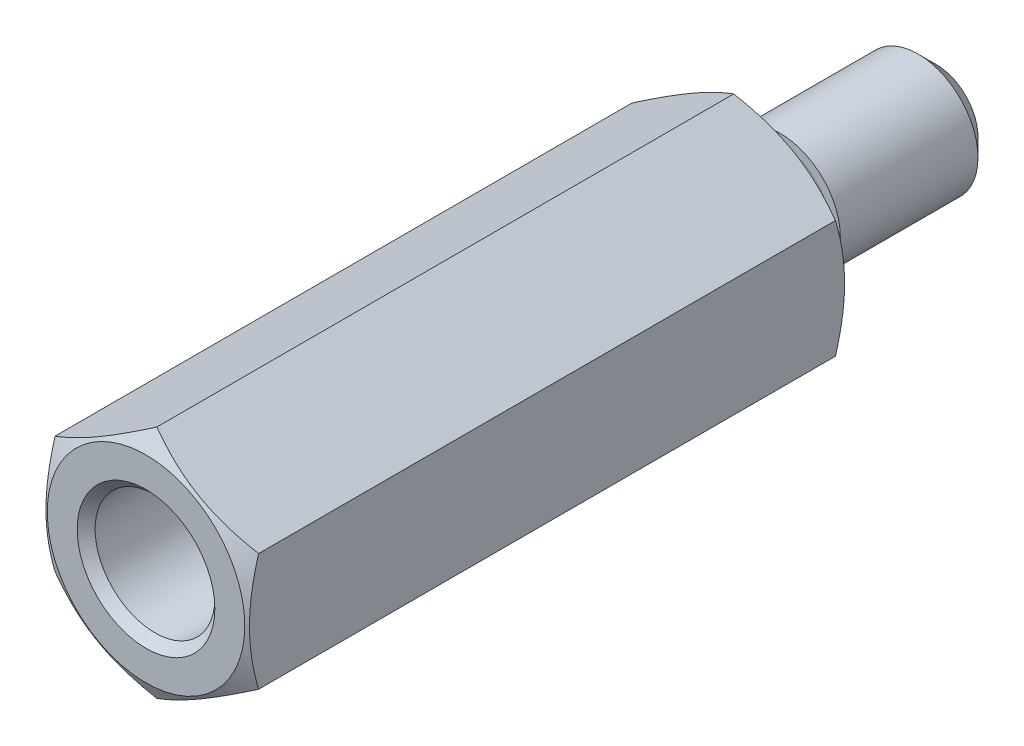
ISO-10303-21;
HEADER;
FILE_DESCRIPTION(('STEP AP214'),'2;1');
FILE_NAME('part.step','',(''),(''),'','','');
FILE_SCHEMA(('AUTOMOTIVE_DESIGN { 1 0 10303 214 1 1 1 1 }'));
ENDSEC;
DATA;
#1=APPLICATION_CONTEXT('core data for automotive mechanical design processes');
#2=APPLICATION_PROTOCOL_DEFINITION('international standard','automotive_design',2000,#1);
#3=PRODUCT_CONTEXT('',#1,'mechanical');
#4=PRODUCT('Part','Part','',(#3));
#5=PRODUCT_RELATED_PRODUCT_CATEGORY('part','',(#4));
#6=PRODUCT_DEFINITION_FORMATION('','',#4);
#7=PRODUCT_DEFINITION_CONTEXT('part definition',#1,'design');
#8=PRODUCT_DEFINITION('design','',#6,#7);
#9=PRODUCT_DEFINITION_SHAPE('','',#8);
#10=(LENGTH_UNIT() NAMED_UNIT(*) SI_UNIT(.MILLI.,.METRE.));
#11=(NAMED_UNIT(*) PLANE_ANGLE_UNIT() SI_UNIT($,.RADIAN.));
#12=(NAMED_UNIT(*) SI_UNIT($,.STERADIAN.) SOLID_ANGLE_UNIT());
#13=UNCERTAINTY_MEASURE_WITH_UNIT(LENGTH_MEASURE(1.E-05),#10,'distance_accuracy_value','');
#14=(GEOMETRIC_REPRESENTATION_CONTEXT(3) GLOBAL_UNCERTAINTY_ASSIGNED_CONTEXT((#13)) GLOBAL_UNIT_ASSIGNED_CONTEXT((#10,
#11,#12)) REPRESENTATION_CONTEXT('',''));
#15=CARTESIAN_POINT('',(0.,0.,0.));
#16=DIRECTION('',(0.,0.,1.));
#17=DIRECTION('',(1.,0.,0.));
#18=AXIS2_PLACEMENT_3D('',#15,#16,#17);
#19=CARTESIAN_POINT('',(8.5,4.90747728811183,0.));
#20=DIRECTION('',(0.,0.,-1.));
#21=DIRECTION('',(-1.,0.,0.));
#22=AXIS2_PLACEMENT_3D('',#19,#20,#21);
#23=PLANE('',#22);
#24=CARTESIAN_POINT('',(0.,0.,0.));
#25=DIRECTION('',(0.,0.,-1.));
#26=DIRECTION('',(-1.,0.,0.));
#27=AXIS2_PLACEMENT_3D('',#24,#25,#26);
#28=CIRCLE('',#27,4.25);
#29=CARTESIAN_POINT('',(-4.25,0.,0.));
#30=VERTEX_POINT('',#29);
#31=EDGE_CURVE('E9',#30,#30,#28,.F.);
#32=ORIENTED_EDGE('',*,*,#31,.T.);
#33=EDGE_LOOP('',(#32));
#34=FACE_BOUND('',#33,.T.);
#35=CARTESIAN_POINT('',(0.,0.,0.));
#36=DIRECTION('',(0.,0.,1.));
#37=DIRECTION('',(1.,0.,0.));
#38=AXIS2_PLACEMENT_3D('',#35,#36,#37);
#39=CIRCLE('',#38,8.25);
#40=CARTESIAN_POINT('',(8.25,0.,0.));
#41=VERTEX_POINT('',#40);
#42=EDGE_CURVE('E136',#41,#41,#39,.T.);
#43=ORIENTED_EDGE('',*,*,#42,.F.);
#44=EDGE_LOOP('',(#43));
#45=FACE_BOUND('',#44,.T.);
#46=ADVANCED_FACE('F14',(#34,#45),#23,.T.);
#47=CARTESIAN_POINT('',(0.,0.,42.756485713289));
#48=DIRECTION('',(0.,0.,1.));
#49=DIRECTION('',(1.,0.,0.));
#50=AXIS2_PLACEMENT_3D('',#47,#48,#49);
#51=CYLINDRICAL_SURFACE('',#50,3.85);
#52=CARTESIAN_POINT('',(0.,0.,-2.6));
#53=DIRECTION('',(0.,0.,-1.));
#54=DIRECTION('',(-1.,0.,0.));
#55=AXIS2_PLACEMENT_3D('',#52,#53,#54);
#56=CIRCLE('',#55,3.85);
#57=CARTESIAN_POINT('',(-3.85,0.,-2.6));
#58=VERTEX_POINT('',#57);
#59=EDGE_CURVE('E103',#58,#58,#56,.F.);
#60=ORIENTED_EDGE('',*,*,#59,.T.);
#61=EDGE_LOOP('',(#60));
#62=FACE_BOUND('',#61,.T.);
#63=CARTESIAN_POINT('',(0.,0.,-0.4));
#64=DIRECTION('',(0.,0.,-1.));
#65=DIRECTION('',(-1.,0.,0.));
#66=AXIS2_PLACEMENT_3D('',#63,#64,#65);
#67=CIRCLE('',#66,3.85);
#68=CARTESIAN_POINT('',(-3.85,0.,-0.4));
#69=VERTEX_POINT('',#68);
#70=EDGE_CURVE('E100',#69,#69,#67,.T.);
#71=ORIENTED_EDGE('',*,*,#70,.T.);
#72=EDGE_LOOP('',(#71));
#73=FACE_BOUND('',#72,.T.);
#74=ADVANCED_FACE('F120',(#62,#73),#51,.T.);
#75=CARTESIAN_POINT('',(0.,3.85,-3.));
#76=DIRECTION('',(0.,0.,-1.));
#77=DIRECTION('',(-1.,0.,0.));
#78=AXIS2_PLACEMENT_3D('',#75,#76,#77);
#79=PLANE('',#78);
#80=CARTESIAN_POINT('',(0.,0.,-3.));
#81=DIRECTION('',(0.,0.,-1.));
#82=DIRECTION('',(-1.,0.,0.));
#83=AXIS2_PLACEMENT_3D('',#80,#81,#82);
#84=CIRCLE('',#83,4.25);
#85=CARTESIAN_POINT('',(-4.25,0.,-3.));
#86=VERTEX_POINT('',#85);
#87=EDGE_CURVE('E24',#86,#86,#84,.T.);
#88=ORIENTED_EDGE('',*,*,#87,.T.);
#89=EDGE_LOOP('',(#88));
#90=FACE_BOUND('',#89,.T.);
#91=CARTESIAN_POINT('',(0.,0.,-3.));
#92=DIRECTION('',(0.,0.,1.));
#93=DIRECTION('',(1.,0.,0.));
#94=AXIS2_PLACEMENT_3D('',#91,#92,#93);
#95=CIRCLE('',#94,5.);
#96=CARTESIAN_POINT('',(5.,0.,-3.));
#97=VERTEX_POINT('',#96);
#98=EDGE_CURVE('E269',#97,#97,#95,.T.);
#99=ORIENTED_EDGE('',*,*,#98,.T.);
#100=EDGE_LOOP('',(#99));
#101=FACE_BOUND('',#100,.T.);
#102=ADVANCED_FACE('F109',(#90,#101),#79,.F.);
#103=CARTESIAN_POINT('',(0.,0.,42.756485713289));
#104=DIRECTION('',(0.,0.,1.));
#105=DIRECTION('',(1.,0.,0.));
#106=AXIS2_PLACEMENT_3D('',#103,#104,#105);
#107=CYLINDRICAL_SURFACE('',#106,5.);
#108=CARTESIAN_POINT('',(0.,0.,-14.5));
#109=DIRECTION('',(0.,0.,1.));
#110=DIRECTION('',(1.,0.,0.));
#111=AXIS2_PLACEMENT_3D('',#108,#109,#110);
#112=CIRCLE('',#111,5.);
#113=CARTESIAN_POINT('',(5.,0.,-14.5));
#114=VERTEX_POINT('',#113);
#115=EDGE_CURVE('E88',#114,#114,#112,.T.);
#116=ORIENTED_EDGE('',*,*,#115,.T.);
#117=EDGE_LOOP('',(#116));
#118=FACE_BOUND('',#117,.T.);
#119=ORIENTED_EDGE('',*,*,#98,.F.);
#120=EDGE_LOOP('',(#119));
#121=FACE_BOUND('',#120,.T.);
#122=ADVANCED_FACE('F392',(#118,#121),#107,.T.);
#123=CARTESIAN_POINT('',(0.,5.,-16.));
#124=DIRECTION('',(0.,0.,1.));
#125=DIRECTION('',(1.,0.,0.));
#126=AXIS2_PLACEMENT_3D('',#123,#124,#125);
#127=PLANE('',#126);
#128=CARTESIAN_POINT('',(0.,0.,-16.));
#129=DIRECTION('',(0.,0.,1.));
#130=DIRECTION('',(1.,0.,0.));
#131=AXIS2_PLACEMENT_3D('',#128,#129,#130);
#132=CIRCLE('',#131,3.5);
#133=CARTESIAN_POINT('',(3.5,0.,-16.));
#134=VERTEX_POINT('',#133);
#135=EDGE_CURVE('E92',#134,#134,#132,.F.);
#136=ORIENTED_EDGE('',*,*,#135,.T.);
#137=EDGE_LOOP('',(#136));
#138=FACE_BOUND('',#137,.T.);
#139=ADVANCED_FACE('F382',(#138),#127,.F.);
#140=CARTESIAN_POINT('',(0.,0.,-14.5));
#141=DIRECTION('',(0.,0.,1.));
#142=DIRECTION('',(1.,0.,0.));
#143=AXIS2_PLACEMENT_3D('',#140,#141,#142);
#144=CONICAL_SURFACE('',#143,5.,0.785398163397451);
#145=ORIENTED_EDGE('',*,*,#135,.F.);
#146=EDGE_LOOP('',(#145));
#147=FACE_BOUND('',#146,.T.);
#148=ORIENTED_EDGE('',*,*,#115,.F.);
#149=EDGE_LOOP('',(#148));
#150=FACE_BOUND('',#149,.T.);
#151=ADVANCED_FACE('F116',(#147,#150),#144,.T.);
#152=CARTESIAN_POINT('',(0.,0.,-2.6));
#153=DIRECTION('',(0.,0.,-1.));
#154=DIRECTION('',(-1.,0.,0.));
#155=AXIS2_PLACEMENT_3D('',#152,#153,#154);
#156=TOROIDAL_SURFACE('',#155,4.25,0.4);
#157=ORIENTED_EDGE('',*,*,#87,.F.);
#158=EDGE_LOOP('',(#157));
#159=FACE_BOUND('',#158,.T.);
#160=ORIENTED_EDGE('',*,*,#59,.F.);
#161=EDGE_LOOP('',(#160));
#162=FACE_BOUND('',#161,.T.);
#163=ADVANCED_FACE('F112',(#159,#162),#156,.F.);
#164=CARTESIAN_POINT('',(0.,0.,-0.4));
#165=DIRECTION('',(0.,0.,-1.));
#166=DIRECTION('',(-1.,0.,0.));
#167=AXIS2_PLACEMENT_3D('',#164,#165,#166);
#168=TOROIDAL_SURFACE('',#167,4.25,0.4);
#169=ORIENTED_EDGE('',*,*,#70,.F.);
#170=EDGE_LOOP('',(#169));
#171=FACE_BOUND('',#170,.T.);
#172=ORIENTED_EDGE('',*,*,#31,.F.);
#173=EDGE_LOOP('',(#172));
#174=FACE_BOUND('',#173,.T.);
#175=ADVANCED_FACE('F115',(#171,#174),#168,.F.);
#176=CARTESIAN_POINT('',(0.,0.,0.903526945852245));
#177=DIRECTION('',(0.,0.,1.));
#178=DIRECTION('',(1.,0.,0.));
#179=AXIS2_PLACEMENT_3D('',#176,#177,#178);
#180=CONICAL_SURFACE('',#179,9.81495457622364,1.0471975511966);
#181=ORIENTED_EDGE('',*,*,#42,.T.);
#182=EDGE_LOOP('',(#181));
#183=FACE_BOUND('',#182,.T.);
#184=CARTESIAN_POINT('',(-0.000199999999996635,9.81507004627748,0.903593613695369));
#185=CARTESIAN_POINT('',(0.186639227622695,9.70719836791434,0.841323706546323));
#186=CARTESIAN_POINT('',(0.374175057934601,9.59892450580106,0.781879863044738));
#187=CARTESIAN_POINT('',(0.750769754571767,9.38149745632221,0.669422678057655));
#188=CARTESIAN_POINT('',(0.939829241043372,9.27234391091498,0.616412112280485));
#189=CARTESIAN_POINT('',(1.5100347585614,8.94313560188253,0.468070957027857));
#190=CARTESIAN_POINT('',(1.89343164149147,8.72178130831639,0.383696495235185));
#191=CARTESIAN_POINT('',(2.46717766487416,8.39052888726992,0.284757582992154));
#192=CARTESIAN_POINT('',(2.65581276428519,8.28162036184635,0.256572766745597));
#193=CARTESIAN_POINT('',(3.03393602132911,8.06331079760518,0.209311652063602));
#194=CARTESIAN_POINT('',(3.22342410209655,7.95390980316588,0.190234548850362));
#195=CARTESIAN_POINT('',(3.60272652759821,7.73491944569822,0.161672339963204));
#196=CARTESIAN_POINT('',(3.7925402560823,7.62533043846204,0.152176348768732));
#197=CARTESIAN_POINT('',(4.17234305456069,7.40605119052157,0.142979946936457));
#198=CARTESIAN_POINT('',(4.36233211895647,7.29636095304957,0.14327923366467));
#199=CARTESIAN_POINT('',(4.71752301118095,7.09129139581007,0.152992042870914));
#200=CARTESIAN_POINT('',(4.8827499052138,6.99589760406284,0.161220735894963));
#201=CARTESIAN_POINT('',(5.21281671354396,6.80533344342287,0.184926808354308));
#202=CARTESIAN_POINT('',(5.37765660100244,6.71016309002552,0.200404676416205));
#203=CARTESIAN_POINT('',(5.87153810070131,6.4250204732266,0.257346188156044));
#204=CARTESIAN_POINT('',(6.19970550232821,6.23555293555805,0.309310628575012));
#205=CARTESIAN_POINT('',(6.85952142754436,5.85460803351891,0.439222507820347));
#206=CARTESIAN_POINT('',(7.19108574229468,5.66317928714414,0.51772063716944));
#207=CARTESIAN_POINT('',(7.84926989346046,5.28317649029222,0.695878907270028));
#208=CARTESIAN_POINT('',(8.17589815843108,5.0945975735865,0.795497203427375));
#209=CARTESIAN_POINT('',(8.5002,4.90736181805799,0.903593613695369));
#210=B_SPLINE_CURVE_WITH_KNOTS('',3,(#184,#185,#186,#187,#188,#189,#190,#191,#192,#193,#194,
#195,#196,#197,#198,#199,#200,#201,#202,#203,#204,#205,#206,#207,#208,#209),.UNSPECIFIED.,.F.,
.F.,(4,2,2,2,2,2,2,2,2,2,2,2,4),(0.,0.673596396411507,1.34748239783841,2.69805431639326,
3.356799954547,4.01548737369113,4.67342558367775,5.33134346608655,5.90409556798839,
6.47688628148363,7.62328361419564,8.79510569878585,9.96462743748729),.UNSPECIFIED.);
#211=CARTESIAN_POINT('',(0.,9.81495457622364,0.903526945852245));
#212=VERTEX_POINT('',#211);
#213=CARTESIAN_POINT('',(8.5,4.90747728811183,0.903526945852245));
#214=VERTEX_POINT('',#213);
#215=EDGE_CURVE('E31',#212,#214,#210,.T.);
#216=ORIENTED_EDGE('',*,*,#215,.T.);
#217=CARTESIAN_POINT('',(8.5,-12.9953438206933,4.20214445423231));
#218=CARTESIAN_POINT('',(8.5,-12.6223011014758,4.02195280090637));
#219=CARTESIAN_POINT('',(8.5,-12.2483741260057,3.84355854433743));
#220=CARTESIAN_POINT('',(8.5,-11.4982734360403,3.49139239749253));
#221=CARTESIAN_POINT('',(8.5,-11.1220993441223,3.31762131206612));
#222=CARTESIAN_POINT('',(8.5,-10.3649842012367,2.97480925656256));
#223=CARTESIAN_POINT('',(8.5,-9.98402817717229,2.80580123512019));
#224=CARTESIAN_POINT('',(8.5,-9.21897765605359,2.47507337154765));
#225=CARTESIAN_POINT('',(8.5,-8.83488332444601,2.31335314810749));
#226=CARTESIAN_POINT('',(8.5,-8.05827000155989,1.99725792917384));
#227=CARTESIAN_POINT('',(8.5,-7.66570525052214,1.84299473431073));
#228=CARTESIAN_POINT('',(8.5,-6.87593938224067,1.54660014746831));
#229=CARTESIAN_POINT('',(8.5,-6.47873775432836,1.40447010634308));
#230=CARTESIAN_POINT('',(8.5,-5.67988381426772,1.13617601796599));
#231=CARTESIAN_POINT('',(8.5,-5.27824308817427,1.00997785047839));
#232=CARTESIAN_POINT('',(8.5,-4.46926711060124,0.777656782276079));
#233=CARTESIAN_POINT('',(8.5,-4.06193370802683,0.671527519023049));
#234=CARTESIAN_POINT('',(8.5,-3.24121808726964,0.484515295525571));
#235=CARTESIAN_POINT('',(8.5,-2.82783404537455,0.403640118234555));
#236=CARTESIAN_POINT('',(8.5,-2.20413783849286,0.305328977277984));
#237=CARTESIAN_POINT('',(8.5,-1.99561028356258,0.276390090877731));
#238=CARTESIAN_POINT('',(8.5,-1.57758365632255,0.226749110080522));
#239=CARTESIAN_POINT('',(8.5,-1.36808467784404,0.206046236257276));
#240=CARTESIAN_POINT('',(8.5,-0.94971684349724,0.173433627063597));
#241=CARTESIAN_POINT('',(8.5,-0.740852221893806,0.161469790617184));
#242=CARTESIAN_POINT('',(8.5,-0.322804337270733,0.146398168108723));
#243=CARTESIAN_POINT('',(8.5,-0.11362107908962,0.143290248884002));
#244=CARTESIAN_POINT('',(8.5,0.3046299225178,0.14600440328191));
#245=CARTESIAN_POINT('',(8.5,0.513697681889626,0.151823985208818));
#246=CARTESIAN_POINT('',(8.5,0.93140649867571,0.172248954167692));
#247=CARTESIAN_POINT('',(8.5,1.14004753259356,0.186854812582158));
#248=CARTESIAN_POINT('',(8.5,1.64621912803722,0.232643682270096));
#249=CARTESIAN_POINT('',(8.5,1.94335676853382,0.268255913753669));
#250=CARTESIAN_POINT('',(8.5,2.53529083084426,0.355313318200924));
#251=CARTESIAN_POINT('',(8.5,2.83008689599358,0.406760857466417));
#252=CARTESIAN_POINT('',(8.5,3.71148367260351,0.582274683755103));
#253=CARTESIAN_POINT('',(8.5,4.29393978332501,0.727394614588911));
#254=CARTESIAN_POINT('',(8.5,5.16515755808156,0.977457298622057));
#255=CARTESIAN_POINT('',(8.5,5.45847541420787,1.06742556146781));
#256=CARTESIAN_POINT('',(8.5,6.04227759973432,1.25629246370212));
#257=CARTESIAN_POINT('',(8.5,6.33276167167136,1.35519190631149));
#258=CARTESIAN_POINT('',(8.5,6.90944623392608,1.55980497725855));
#259=CARTESIAN_POINT('',(8.5,7.19566165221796,1.66547695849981));
#260=CARTESIAN_POINT('',(8.5,7.76565926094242,1.88291533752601));
#261=CARTESIAN_POINT('',(8.5,8.04944225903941,1.99467961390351));
#262=CARTESIAN_POINT('',(8.5,8.33220149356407,2.10891920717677));
#263=B_SPLINE_CURVE_WITH_KNOTS('',3,(#217,#218,#219,#220,#221,#222,#223,#224,#225,#226,#227,
#228,#229,#230,#231,#232,#233,#234,#235,#236,#237,#238,#239,#240,#241,#242,#243,#244,#245,#246,
#247,#248,#249,#250,#251,#252,#253,#254,#255,#256,#257,#258,#259,#260,#261,#262),.UNSPECIFIED.,
.F.,.F.,(4,2,2,2,2,2,2,2,2,2,2,2,2,2,2,2,2,2,2,2,2,2,4),(0.,1.24286396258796,2.48594289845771,
3.73617049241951,4.98633259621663,6.25153784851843,7.51688378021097,8.77947209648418,
10.0416594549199,11.3042354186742,11.93567629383,12.5670573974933,13.1944958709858,
13.8219249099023,14.4491788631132,15.0764664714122,15.9737486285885,16.8711649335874,
18.6694595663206,19.5898052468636,20.5102337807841,21.4254630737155,22.3403756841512),.UNSPECIFIED.);
#264=CARTESIAN_POINT('',(8.5,-4.90747728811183,0.903526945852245));
#265=VERTEX_POINT('',#264);
#266=EDGE_CURVE('E138',#214,#265,#263,.F.);
#267=ORIENTED_EDGE('',*,*,#266,.T.);
#268=CARTESIAN_POINT('',(8.5002,-4.90736181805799,0.903593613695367));
#269=CARTESIAN_POINT('',(8.31336077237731,-5.01523349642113,0.841323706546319));
#270=CARTESIAN_POINT('',(8.1258249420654,-5.12350735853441,0.781879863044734));
#271=CARTESIAN_POINT('',(7.74923024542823,-5.34093440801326,0.66942267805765));
#272=CARTESIAN_POINT('',(7.56017075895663,-5.45008795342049,0.61641211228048));
#273=CARTESIAN_POINT('',(6.9899652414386,-5.77929626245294,0.468070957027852));
#274=CARTESIAN_POINT('',(6.60656835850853,-6.00065055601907,0.383696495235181));
#275=CARTESIAN_POINT('',(6.03282233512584,-6.33190297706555,0.28475758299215));
#276=CARTESIAN_POINT('',(5.84418723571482,-6.44081150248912,0.256572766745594));
#277=CARTESIAN_POINT('',(5.46606397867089,-6.65912106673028,0.209311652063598));
#278=CARTESIAN_POINT('',(5.27657589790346,-6.76852206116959,0.190234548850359));
#279=CARTESIAN_POINT('',(4.8972734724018,-6.98751241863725,0.161672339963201));
#280=CARTESIAN_POINT('',(4.70745974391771,-7.09710142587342,0.152176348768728));
#281=CARTESIAN_POINT('',(4.32765694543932,-7.3163806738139,0.142979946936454));
#282=CARTESIAN_POINT('',(4.13766788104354,-7.42607091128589,0.143279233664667));
#283=CARTESIAN_POINT('',(3.78247698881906,-7.63114046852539,0.152992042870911));
#284=CARTESIAN_POINT('',(3.6172500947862,-7.72653426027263,0.161220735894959));
#285=CARTESIAN_POINT('',(3.28718328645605,-7.9170984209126,0.184926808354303));
#286=CARTESIAN_POINT('',(3.12234339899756,-8.01226877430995,0.2004046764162));
#287=CARTESIAN_POINT('',(2.62846189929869,-8.29741139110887,0.25734618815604));
#288=CARTESIAN_POINT('',(2.30029449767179,-8.48687892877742,0.309310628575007));
#289=CARTESIAN_POINT('',(1.64047857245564,-8.86782383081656,0.439222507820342));
#290=CARTESIAN_POINT('',(1.30891425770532,-9.05925257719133,0.517720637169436));
#291=CARTESIAN_POINT('',(0.650730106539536,-9.43925537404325,0.695878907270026));
#292=CARTESIAN_POINT('',(0.324101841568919,-9.62783429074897,0.795497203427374));
#293=CARTESIAN_POINT('',(-0.000200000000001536,-9.81507004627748,0.903593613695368));
#294=B_SPLINE_CURVE_WITH_KNOTS('',3,(#268,#269,#270,#271,#272,#273,#274,#275,#276,#277,#278,
#279,#280,#281,#282,#283,#284,#285,#286,#287,#288,#289,#290,#291,#292,#293),.UNSPECIFIED.,.F.,
.F.,(4,2,2,2,2,2,2,2,2,2,2,2,4),(0.,0.673596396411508,1.34748239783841,2.69805431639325,
3.35679995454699,4.01548737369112,4.67342558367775,5.33134346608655,5.90409556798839,
6.47688628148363,7.62328361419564,8.79510569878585,9.9646274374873),.UNSPECIFIED.);
#295=CARTESIAN_POINT('',(0.,-9.81495457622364,0.903526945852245));
#296=VERTEX_POINT('',#295);
#297=EDGE_CURVE('E140',#265,#296,#294,.T.);
#298=ORIENTED_EDGE('',*,*,#297,.T.);
#299=CARTESIAN_POINT('',(0.000199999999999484,-9.81507004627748,0.903593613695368));
#300=CARTESIAN_POINT('',(-0.18663922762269,-9.70719836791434,0.84132370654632));
#301=CARTESIAN_POINT('',(-0.374175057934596,-9.59892450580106,0.781879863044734));
#302=CARTESIAN_POINT('',(-0.750769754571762,-9.3814974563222,0.66942267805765));
#303=CARTESIAN_POINT('',(-0.939829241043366,-9.27234391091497,0.616412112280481));
#304=CARTESIAN_POINT('',(-1.5100347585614,-8.94313560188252,0.468070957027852));
#305=CARTESIAN_POINT('',(-1.89343164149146,-8.72178130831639,0.38369649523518));
#306=CARTESIAN_POINT('',(-2.46717766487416,-8.39052888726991,0.28475758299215));
#307=CARTESIAN_POINT('',(-2.65581276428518,-8.28162036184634,0.256572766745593));
#308=CARTESIAN_POINT('',(-3.03393602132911,-8.06331079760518,0.209311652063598));
#309=CARTESIAN_POINT('',(-3.22342410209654,-7.95390980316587,0.190234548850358));
#310=CARTESIAN_POINT('',(-3.6027265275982,-7.73491944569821,0.1616723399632));
#311=CARTESIAN_POINT('',(-3.79254025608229,-7.62533043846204,0.152176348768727));
#312=CARTESIAN_POINT('',(-4.17234305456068,-7.40605119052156,0.142979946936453));
#313=CARTESIAN_POINT('',(-4.36233211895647,-7.29636095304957,0.143279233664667));
#314=CARTESIAN_POINT('',(-4.71752301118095,-7.09129139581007,0.152992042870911));
#315=CARTESIAN_POINT('',(-4.8827499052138,-6.99589760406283,0.161220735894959));
#316=CARTESIAN_POINT('',(-5.21281671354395,-6.80533344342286,0.184926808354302));
#317=CARTESIAN_POINT('',(-5.37765660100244,-6.71016309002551,0.200404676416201));
#318=CARTESIAN_POINT('',(-5.87153810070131,-6.42502047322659,0.257346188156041));
#319=CARTESIAN_POINT('',(-6.19970550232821,-6.23555293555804,0.309310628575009));
#320=CARTESIAN_POINT('',(-6.85952142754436,-5.8546080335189,0.439222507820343));
#321=CARTESIAN_POINT('',(-7.19108574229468,-5.66317928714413,0.517720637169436));
#322=CARTESIAN_POINT('',(-7.84926989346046,-5.28317649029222,0.695878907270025));
#323=CARTESIAN_POINT('',(-8.17589815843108,-5.09459757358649,0.795497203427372));
#324=CARTESIAN_POINT('',(-8.5002,-4.90736181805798,0.903593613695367));
#325=B_SPLINE_CURVE_WITH_KNOTS('',3,(#299,#300,#301,#302,#303,#304,#305,#306,#307,#308,#309,
#310,#311,#312,#313,#314,#315,#316,#317,#318,#319,#320,#321,#322,#323,#324),.UNSPECIFIED.,.F.,
.F.,(4,2,2,2,2,2,2,2,2,2,2,2,4),(0.,0.673596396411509,1.34748239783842,2.69805431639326,
3.356799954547,4.01548737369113,4.67342558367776,5.33134346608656,5.9040955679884,
6.47688628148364,7.62328361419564,8.79510569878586,9.9646274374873),.UNSPECIFIED.);
#326=CARTESIAN_POINT('',(-8.5,-4.90747728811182,0.903526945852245));
#327=VERTEX_POINT('',#326);
#328=EDGE_CURVE('E237',#296,#327,#325,.T.);
#329=ORIENTED_EDGE('',*,*,#328,.T.);
#330=CARTESIAN_POINT('',(-8.5,-12.9953438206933,4.20214445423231));
#331=CARTESIAN_POINT('',(-8.5,-12.6223011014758,4.02195280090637));
#332=CARTESIAN_POINT('',(-8.5,-12.2483741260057,3.84355854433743));
#333=CARTESIAN_POINT('',(-8.5,-11.4982734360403,3.49139239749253));
#334=CARTESIAN_POINT('',(-8.5,-11.1220993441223,3.31762131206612));
#335=CARTESIAN_POINT('',(-8.5,-10.3649842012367,2.97480925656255));
#336=CARTESIAN_POINT('',(-8.5,-9.98402817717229,2.80580123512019));
#337=CARTESIAN_POINT('',(-8.5,-9.21897765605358,2.47507337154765));
#338=CARTESIAN_POINT('',(-8.5,-8.834883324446,2.31335314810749));
#339=CARTESIAN_POINT('',(-8.5,-8.05827000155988,1.99725792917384));
#340=CARTESIAN_POINT('',(-8.5,-7.66570525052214,1.84299473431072));
#341=CARTESIAN_POINT('',(-8.5,-6.87593938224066,1.54660014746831));
#342=CARTESIAN_POINT('',(-8.5,-6.47873775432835,1.40447010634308));
#343=CARTESIAN_POINT('',(-8.5,-5.67988381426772,1.13617601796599));
#344=CARTESIAN_POINT('',(-8.5,-5.27824308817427,1.00997785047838));
#345=CARTESIAN_POINT('',(-8.5,-4.46926711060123,0.777656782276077));
#346=CARTESIAN_POINT('',(-8.5,-4.06193370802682,0.671527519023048));
#347=CARTESIAN_POINT('',(-8.5,-3.24121808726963,0.48451529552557));
#348=CARTESIAN_POINT('',(-8.5,-2.82783404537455,0.403640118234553));
#349=CARTESIAN_POINT('',(-8.5,-2.20413783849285,0.305328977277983));
#350=CARTESIAN_POINT('',(-8.5,-1.99561028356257,0.27639009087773));
#351=CARTESIAN_POINT('',(-8.5,-1.57758365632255,0.226749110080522));
#352=CARTESIAN_POINT('',(-8.5,-1.36808467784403,0.206046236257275));
#353=CARTESIAN_POINT('',(-8.5,-0.949716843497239,0.173433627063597));
#354=CARTESIAN_POINT('',(-8.5,-0.740852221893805,0.161469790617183));
#355=CARTESIAN_POINT('',(-8.5,-0.322804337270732,0.146398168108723));
#356=CARTESIAN_POINT('',(-8.5,-0.113621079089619,0.143290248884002));
#357=CARTESIAN_POINT('',(-8.5,0.304629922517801,0.146004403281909));
#358=CARTESIAN_POINT('',(-8.5,0.513697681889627,0.151823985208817));
#359=CARTESIAN_POINT('',(-8.5,0.931406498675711,0.172248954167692));
#360=CARTESIAN_POINT('',(-8.5,1.14004753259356,0.186854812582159));
#361=CARTESIAN_POINT('',(-8.5,1.64621912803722,0.232643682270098));
#362=CARTESIAN_POINT('',(-8.5,1.94335676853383,0.268255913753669));
#363=CARTESIAN_POINT('',(-8.5,2.53529083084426,0.355313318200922));
#364=CARTESIAN_POINT('',(-8.5,2.83008689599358,0.406760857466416));
#365=CARTESIAN_POINT('',(-8.5,3.71148367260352,0.582274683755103));
#366=CARTESIAN_POINT('',(-8.5,4.29393978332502,0.727394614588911));
#367=CARTESIAN_POINT('',(-8.5,5.16515755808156,0.977457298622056));
#368=CARTESIAN_POINT('',(-8.5,5.45847541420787,1.06742556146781));
#369=CARTESIAN_POINT('',(-8.5,6.04227759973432,1.25629246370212));
#370=CARTESIAN_POINT('',(-8.5,6.33276167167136,1.35519190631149));
#371=CARTESIAN_POINT('',(-8.5,6.90944623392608,1.55980497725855));
#372=CARTESIAN_POINT('',(-8.5,7.19566165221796,1.66547695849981));
#373=CARTESIAN_POINT('',(-8.5,7.76565926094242,1.88291533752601));
#374=CARTESIAN_POINT('',(-8.5,8.04944225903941,1.99467961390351));
#375=CARTESIAN_POINT('',(-8.5,8.33220149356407,2.10891920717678));
#376=B_SPLINE_CURVE_WITH_KNOTS('',3,(#330,#331,#332,#333,#334,#335,#336,#337,#338,#339,#340,
#341,#342,#343,#344,#345,#346,#347,#348,#349,#350,#351,#352,#353,#354,#355,#356,#357,#358,#359,
#360,#361,#362,#363,#364,#365,#366,#367,#368,#369,#370,#371,#372,#373,#374,#375),.UNSPECIFIED.,
.F.,.F.,(4,2,2,2,2,2,2,2,2,2,2,2,2,2,2,2,2,2,2,2,2,2,4),(0.,1.24286396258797,2.48594289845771,
3.73617049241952,4.98633259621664,6.25153784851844,7.51688378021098,8.77947209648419,
10.0416594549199,11.3042354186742,11.93567629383,12.5670573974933,13.1944958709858,
13.8219249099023,14.4491788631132,15.0764664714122,15.9737486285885,16.8711649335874,
18.6694595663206,19.5898052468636,20.5102337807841,21.4254630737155,22.3403756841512),.UNSPECIFIED.);
#377=CARTESIAN_POINT('',(-8.5,4.90747728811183,0.903526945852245));
#378=VERTEX_POINT('',#377);
#379=EDGE_CURVE('E70',#327,#378,#376,.T.);
#380=ORIENTED_EDGE('',*,*,#379,.T.);
#381=CARTESIAN_POINT('',(-8.5002,4.90736181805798,0.903593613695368));
#382=CARTESIAN_POINT('',(-8.31336077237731,5.01523349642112,0.84132370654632));
#383=CARTESIAN_POINT('',(-8.1258249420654,5.1235073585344,0.781879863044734));
#384=CARTESIAN_POINT('',(-7.74923024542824,5.34093440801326,0.66942267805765));
#385=CARTESIAN_POINT('',(-7.56017075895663,5.45008795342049,0.616412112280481));
#386=CARTESIAN_POINT('',(-6.9899652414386,5.77929626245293,0.468070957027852));
#387=CARTESIAN_POINT('',(-6.60656835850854,6.00065055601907,0.38369649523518));
#388=CARTESIAN_POINT('',(-6.03282233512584,6.33190297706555,0.28475758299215));
#389=CARTESIAN_POINT('',(-5.84418723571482,6.44081150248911,0.256572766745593));
#390=CARTESIAN_POINT('',(-5.46606397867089,6.65912106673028,0.209311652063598));
#391=CARTESIAN_POINT('',(-5.27657589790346,6.76852206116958,0.190234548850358));
#392=CARTESIAN_POINT('',(-4.8972734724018,6.98751241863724,0.161672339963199));
#393=CARTESIAN_POINT('',(-4.70745974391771,7.09710142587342,0.152176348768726));
#394=CARTESIAN_POINT('',(-4.32765694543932,7.31638067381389,0.142979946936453));
#395=CARTESIAN_POINT('',(-4.13766788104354,7.42607091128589,0.143279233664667));
#396=CARTESIAN_POINT('',(-3.78247698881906,7.63114046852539,0.15299204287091));
#397=CARTESIAN_POINT('',(-3.6172500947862,7.72653426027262,0.161220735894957));
#398=CARTESIAN_POINT('',(-3.28718328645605,7.9170984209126,0.184926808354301));
#399=CARTESIAN_POINT('',(-3.12234339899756,8.01226877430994,0.200404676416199));
#400=CARTESIAN_POINT('',(-2.62846189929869,8.29741139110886,0.257346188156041));
#401=CARTESIAN_POINT('',(-2.30029449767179,8.48687892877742,0.309310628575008));
#402=CARTESIAN_POINT('',(-1.64047857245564,8.86782383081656,0.439222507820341));
#403=CARTESIAN_POINT('',(-1.30891425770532,9.05925257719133,0.517720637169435));
#404=CARTESIAN_POINT('',(-0.650730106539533,9.43925537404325,0.695878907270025));
#405=CARTESIAN_POINT('',(-0.324101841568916,9.62783429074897,0.795497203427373));
#406=CARTESIAN_POINT('',(0.000200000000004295,9.81507004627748,0.903593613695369));
#407=B_SPLINE_CURVE_WITH_KNOTS('',3,(#381,#382,#383,#384,#385,#386,#387,#388,#389,#390,#391,
#392,#393,#394,#395,#396,#397,#398,#399,#400,#401,#402,#403,#404,#405,#406),.UNSPECIFIED.,.F.,
.F.,(4,2,2,2,2,2,2,2,2,2,2,2,4),(0.,0.673596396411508,1.34748239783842,2.69805431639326,
3.356799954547,4.01548737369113,4.67342558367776,5.33134346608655,5.90409556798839,
6.47688628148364,7.62328361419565,8.79510569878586,9.96462743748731),.UNSPECIFIED.);
#408=EDGE_CURVE('E67',#378,#212,#407,.T.);
#409=ORIENTED_EDGE('',*,*,#408,.T.);
#410=EDGE_LOOP('',(#216,#267,#298,#329,#380,#409));
#411=FACE_BOUND('',#410,.T.);
#412=ADVANCED_FACE('F68',(#183,#411),#180,.T.);
#413=CARTESIAN_POINT('',(0.,0.,50.));
#414=DIRECTION('',(0.,0.,1.));
#415=DIRECTION('',(1.,0.,0.));
#416=AXIS2_PLACEMENT_3D('',#413,#414,#415);
#417=CONICAL_SURFACE('',#416,5.75,0.785398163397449);
#418=CARTESIAN_POINT('',(0.,0.,49.25));
#419=DIRECTION('',(0.,0.,1.));
#420=DIRECTION('',(1.,0.,0.));
#421=AXIS2_PLACEMENT_3D('',#418,#419,#420);
#422=CIRCLE('',#421,5.);
#423=CARTESIAN_POINT('',(5.,0.,49.25));
#424=VERTEX_POINT('',#423);
#425=EDGE_CURVE('E19',#424,#424,#422,.F.);
#426=ORIENTED_EDGE('',*,*,#425,.T.);
#427=EDGE_LOOP('',(#426));
#428=FACE_BOUND('',#427,.T.);
#429=CARTESIAN_POINT('',(0.,0.,50.));
#430=DIRECTION('',(0.,0.,1.));
#431=DIRECTION('',(1.,0.,0.));
#432=AXIS2_PLACEMENT_3D('',#429,#430,#431);
#433=CIRCLE('',#432,5.75);
#434=CARTESIAN_POINT('',(5.75,0.,50.));
#435=VERTEX_POINT('',#434);
#436=EDGE_CURVE('E271',#435,#435,#433,.T.);
#437=ORIENTED_EDGE('',*,*,#436,.T.);
#438=EDGE_LOOP('',(#437));
#439=FACE_BOUND('',#438,.T.);
#440=ADVANCED_FACE('F189',(#428,#439),#417,.F.);
#441=CARTESIAN_POINT('',(8.5,4.90747728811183,50.));
#442=DIRECTION('',(0.,0.,-1.));
#443=DIRECTION('',(-1.,0.,0.));
#444=AXIS2_PLACEMENT_3D('',#441,#442,#443);
#445=PLANE('',#444);
#446=ORIENTED_EDGE('',*,*,#436,.F.);
#447=EDGE_LOOP('',(#446));
#448=FACE_BOUND('',#447,.T.);
#449=CARTESIAN_POINT('',(0.,0.,50.));
#450=DIRECTION('',(0.,0.,1.));
#451=DIRECTION('',(1.,0.,0.));
#452=AXIS2_PLACEMENT_3D('',#449,#450,#451);
#453=CIRCLE('',#452,8.25);
#454=CARTESIAN_POINT('',(8.25,0.,50.));
#455=VERTEX_POINT('',#454);
#456=EDGE_CURVE('E83',#455,#455,#453,.T.);
#457=ORIENTED_EDGE('',*,*,#456,.T.);
#458=EDGE_LOOP('',(#457));
#459=FACE_BOUND('',#458,.T.);
#460=ADVANCED_FACE('F168',(#448,#459),#445,.F.);
#461=CARTESIAN_POINT('',(0.,0.,50.));
#462=DIRECTION('',(0.,0.,-1.));
#463=DIRECTION('',(-1.,0.,0.));
#464=AXIS2_PLACEMENT_3D('',#461,#462,#463);
#465=CONICAL_SURFACE('',#464,8.25,1.0471975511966);
#466=ORIENTED_EDGE('',*,*,#456,.F.);
#467=EDGE_LOOP('',(#466));
#468=FACE_BOUND('',#467,.T.);
#469=CARTESIAN_POINT('',(8.5002,4.90736181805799,49.0964063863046));
#470=CARTESIAN_POINT('',(8.31336077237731,5.01523349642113,49.1586762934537));
#471=CARTESIAN_POINT('',(8.12582494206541,5.12350735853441,49.2181201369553));
#472=CARTESIAN_POINT('',(7.74923024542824,5.34093440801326,49.3305773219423));
#473=CARTESIAN_POINT('',(7.56017075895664,5.4500879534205,49.3835878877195));
#474=CARTESIAN_POINT('',(6.9899652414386,5.77929626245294,49.5319290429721));
#475=CARTESIAN_POINT('',(6.60656835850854,6.00065055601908,49.6163035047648));
#476=CARTESIAN_POINT('',(6.03282233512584,6.33190297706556,49.7152424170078));
#477=CARTESIAN_POINT('',(5.84418723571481,6.44081150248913,49.7434272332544));
#478=CARTESIAN_POINT('',(5.46606397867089,6.65912106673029,49.7906883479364));
#479=CARTESIAN_POINT('',(5.27657589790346,6.76852206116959,49.8097654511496));
#480=CARTESIAN_POINT('',(4.8972734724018,6.98751241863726,49.8383276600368));
#481=CARTESIAN_POINT('',(4.70745974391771,7.09710142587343,49.8478236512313));
#482=CARTESIAN_POINT('',(4.32765694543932,7.3163806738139,49.8570200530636));
#483=CARTESIAN_POINT('',(4.13766788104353,7.42607091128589,49.8567207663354));
#484=CARTESIAN_POINT('',(3.78247698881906,7.63114046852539,49.8470079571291));
#485=CARTESIAN_POINT('',(3.61725009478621,7.72653426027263,49.838779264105));
#486=CARTESIAN_POINT('',(3.28718328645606,7.9170984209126,49.8150731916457));
#487=CARTESIAN_POINT('',(3.12234339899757,8.01226877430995,49.7995953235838));
#488=CARTESIAN_POINT('',(2.6284618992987,8.29741139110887,49.742653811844));
#489=CARTESIAN_POINT('',(2.3002944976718,8.48687892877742,49.690689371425));
#490=CARTESIAN_POINT('',(1.64047857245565,8.86782383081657,49.5607774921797));
#491=CARTESIAN_POINT('',(1.30891425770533,9.05925257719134,49.4822793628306));
#492=CARTESIAN_POINT('',(0.650730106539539,9.43925537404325,49.30412109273));
#493=CARTESIAN_POINT('',(0.324101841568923,9.62783429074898,49.2045027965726));
#494=CARTESIAN_POINT('',(-0.000199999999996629,9.81507004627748,49.0964063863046));
#495=B_SPLINE_CURVE_WITH_KNOTS('',3,(#469,#470,#471,#472,#473,#474,#475,#476,#477,#478,#479,
#480,#481,#482,#483,#484,#485,#486,#487,#488,#489,#490,#491,#492,#493,#494),.UNSPECIFIED.,.F.,
.F.,(4,2,2,2,2,2,2,2,2,2,2,2,4),(0.,0.673596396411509,1.34748239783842,2.69805431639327,
3.35679995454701,4.01548737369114,4.67342558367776,5.33134346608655,5.90409556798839,
6.47688628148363,7.62328361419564,8.79510569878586,9.96462743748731),.UNSPECIFIED.);
#496=CARTESIAN_POINT('',(8.5,4.90747728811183,49.0964730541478));
#497=VERTEX_POINT('',#496);
#498=CARTESIAN_POINT('',(0.,9.81495457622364,49.0964730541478));
#499=VERTEX_POINT('',#498);
#500=EDGE_CURVE('E213',#497,#499,#495,.T.);
#501=ORIENTED_EDGE('',*,*,#500,.T.);
#502=CARTESIAN_POINT('',(0.000200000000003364,9.81507004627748,49.0964063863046));
#503=CARTESIAN_POINT('',(-0.186639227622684,9.70719836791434,49.1586762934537));
#504=CARTESIAN_POINT('',(-0.374175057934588,9.59892450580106,49.2181201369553));
#505=CARTESIAN_POINT('',(-0.750769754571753,9.3814974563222,49.3305773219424));
#506=CARTESIAN_POINT('',(-0.939829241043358,9.27234391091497,49.3835878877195));
#507=CARTESIAN_POINT('',(-1.51003475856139,8.94313560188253,49.5319290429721));
#508=CARTESIAN_POINT('',(-1.89343164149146,8.72178130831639,49.6163035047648));
#509=CARTESIAN_POINT('',(-2.46717766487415,8.39052888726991,49.7152424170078));
#510=CARTESIAN_POINT('',(-2.65581276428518,8.28162036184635,49.7434272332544));
#511=CARTESIAN_POINT('',(-3.0339360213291,8.06331079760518,49.7906883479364));
#512=CARTESIAN_POINT('',(-3.22342410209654,7.95390980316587,49.8097654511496));
#513=CARTESIAN_POINT('',(-3.60272652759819,7.73491944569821,49.8383276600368));
#514=CARTESIAN_POINT('',(-3.79254025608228,7.62533043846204,49.8478236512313));
#515=CARTESIAN_POINT('',(-4.17234305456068,7.40605119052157,49.8570200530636));
#516=CARTESIAN_POINT('',(-4.36233211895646,7.29636095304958,49.8567207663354));
#517=CARTESIAN_POINT('',(-4.71752301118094,7.09129139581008,49.8470079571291));
#518=CARTESIAN_POINT('',(-4.88274990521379,6.99589760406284,49.838779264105));
#519=CARTESIAN_POINT('',(-5.21281671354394,6.80533344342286,49.8150731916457));
#520=CARTESIAN_POINT('',(-5.37765660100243,6.71016309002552,49.7995953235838));
#521=CARTESIAN_POINT('',(-5.8715381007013,6.4250204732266,49.742653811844));
#522=CARTESIAN_POINT('',(-6.1997055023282,6.23555293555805,49.690689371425));
#523=CARTESIAN_POINT('',(-6.85952142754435,5.8546080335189,49.5607774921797));
#524=CARTESIAN_POINT('',(-7.19108574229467,5.66317928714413,49.4822793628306));
#525=CARTESIAN_POINT('',(-7.84926989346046,5.28317649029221,49.30412109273));
#526=CARTESIAN_POINT('',(-8.17589815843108,5.09459757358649,49.2045027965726));
#527=CARTESIAN_POINT('',(-8.5002,4.90736181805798,49.0964063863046));
#528=B_SPLINE_CURVE_WITH_KNOTS('',3,(#502,#503,#504,#505,#506,#507,#508,#509,#510,#511,#512,
#513,#514,#515,#516,#517,#518,#519,#520,#521,#522,#523,#524,#525,#526,#527),.UNSPECIFIED.,.F.,
.F.,(4,2,2,2,2,2,2,2,2,2,2,2,4),(0.,0.673596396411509,1.34748239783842,2.69805431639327,
3.35679995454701,4.01548737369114,4.67342558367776,5.33134346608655,5.90409556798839,
6.47688628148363,7.62328361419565,8.79510569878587,9.96462743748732),.UNSPECIFIED.);
#529=CARTESIAN_POINT('',(-8.5,4.90747728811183,49.0964730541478));
#530=VERTEX_POINT('',#529);
#531=EDGE_CURVE('E87',#499,#530,#528,.T.);
#532=ORIENTED_EDGE('',*,*,#531,.T.);
#533=CARTESIAN_POINT('',(-8.5,-12.9953438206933,45.7978555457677));
#534=CARTESIAN_POINT('',(-8.5,-12.6223011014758,45.9780471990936));
#535=CARTESIAN_POINT('',(-8.5,-12.2483741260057,46.1564414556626));
#536=CARTESIAN_POINT('',(-8.5,-11.4982734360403,46.5086076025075));
#537=CARTESIAN_POINT('',(-8.5,-11.1220993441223,46.6823786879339));
#538=CARTESIAN_POINT('',(-8.5,-10.3649842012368,47.0251907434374));
#539=CARTESIAN_POINT('',(-8.5,-9.98402817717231,47.1941987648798));
#540=CARTESIAN_POINT('',(-8.5,-9.21897765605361,47.5249266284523));
#541=CARTESIAN_POINT('',(-8.5,-8.83488332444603,47.6866468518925));
#542=CARTESIAN_POINT('',(-8.5,-8.0582700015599,48.0027420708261));
#543=CARTESIAN_POINT('',(-8.5,-7.66570525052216,48.1570052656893));
#544=CARTESIAN_POINT('',(-8.5,-6.87593938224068,48.4533998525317));
#545=CARTESIAN_POINT('',(-8.5,-6.47873775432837,48.5955298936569));
#546=CARTESIAN_POINT('',(-8.5,-5.67988381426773,48.863823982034));
#547=CARTESIAN_POINT('',(-8.5,-5.27824308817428,48.9900221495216));
#548=CARTESIAN_POINT('',(-8.5,-4.46926711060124,49.2223432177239));
#549=CARTESIAN_POINT('',(-8.5,-4.06193370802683,49.3284724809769));
#550=CARTESIAN_POINT('',(-8.5,-3.24121808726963,49.5154847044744));
#551=CARTESIAN_POINT('',(-8.5,-2.82783404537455,49.5963598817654));
#552=CARTESIAN_POINT('',(-8.5,-2.20413783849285,49.694671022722));
#553=CARTESIAN_POINT('',(-8.5,-1.99561028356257,49.7236099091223));
#554=CARTESIAN_POINT('',(-8.5,-1.57758365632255,49.7732508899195));
#555=CARTESIAN_POINT('',(-8.5,-1.36808467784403,49.7939537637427));
#556=CARTESIAN_POINT('',(-8.5,-0.949716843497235,49.8265663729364));
#557=CARTESIAN_POINT('',(-8.5,-0.740852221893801,49.8385302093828));
#558=CARTESIAN_POINT('',(-8.5,-0.322804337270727,49.8536018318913));
#559=CARTESIAN_POINT('',(-8.5,-0.113621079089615,49.856709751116));
#560=CARTESIAN_POINT('',(-8.5,0.304629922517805,49.8539955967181));
#561=CARTESIAN_POINT('',(-8.5,0.51369768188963,49.8481760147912));
#562=CARTESIAN_POINT('',(-8.5,0.931406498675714,49.8277510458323));
#563=CARTESIAN_POINT('',(-8.5,1.14004753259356,49.8131451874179));
#564=CARTESIAN_POINT('',(-8.5,1.64621912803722,49.7673563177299));
#565=CARTESIAN_POINT('',(-8.5,1.94335676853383,49.7317440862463));
#566=CARTESIAN_POINT('',(-8.5,2.53529083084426,49.6446866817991));
#567=CARTESIAN_POINT('',(-8.5,2.83008689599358,49.5932391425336));
#568=CARTESIAN_POINT('',(-8.5,3.71148367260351,49.4177253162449));
#569=CARTESIAN_POINT('',(-8.5,4.29393978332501,49.2726053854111));
#570=CARTESIAN_POINT('',(-8.5,5.16515755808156,49.0225427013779));
#571=CARTESIAN_POINT('',(-8.5,5.45847541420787,48.9325744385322));
#572=CARTESIAN_POINT('',(-8.5,6.04227759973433,48.7437075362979));
#573=CARTESIAN_POINT('',(-8.5,6.33276167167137,48.6448080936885));
#574=CARTESIAN_POINT('',(-8.5,6.90944623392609,48.4401950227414));
#575=CARTESIAN_POINT('',(-8.5,7.19566165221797,48.3345230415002));
#576=CARTESIAN_POINT('',(-8.5,7.76565926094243,48.117084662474));
#577=CARTESIAN_POINT('',(-8.5,8.04944225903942,48.0053203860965));
#578=CARTESIAN_POINT('',(-8.5,8.33220149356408,47.8910807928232));
#579=B_SPLINE_CURVE_WITH_KNOTS('',3,(#533,#534,#535,#536,#537,#538,#539,#540,#541,#542,#543,
#544,#545,#546,#547,#548,#549,#550,#551,#552,#553,#554,#555,#556,#557,#558,#559,#560,#561,#562,
#563,#564,#565,#566,#567,#568,#569,#570,#571,#572,#573,#574,#575,#576,#577,#578),.UNSPECIFIED.,
.F.,.F.,(4,2,2,2,2,2,2,2,2,2,2,2,2,2,2,2,2,2,2,2,2,2,4),(0.,1.24286396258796,2.4859428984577,
3.7361704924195,4.98633259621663,6.25153784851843,7.51688378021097,8.77947209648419,
10.0416594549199,11.3042354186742,11.93567629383,12.5670573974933,13.1944958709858,
13.8219249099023,14.4491788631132,15.0764664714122,15.9737486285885,16.8711649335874,
18.6694595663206,19.5898052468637,20.5102337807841,21.4254630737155,22.3403756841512),.UNSPECIFIED.);
#580=CARTESIAN_POINT('',(-8.5,-4.90747728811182,49.0964730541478));
#581=VERTEX_POINT('',#580);
#582=EDGE_CURVE('E202',#530,#581,#579,.F.);
#583=ORIENTED_EDGE('',*,*,#582,.T.);
#584=CARTESIAN_POINT('',(-8.5002,-4.90736181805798,49.0964063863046));
#585=CARTESIAN_POINT('',(-8.31336077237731,-5.01523349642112,49.1586762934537));
#586=CARTESIAN_POINT('',(-8.12582494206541,-5.1235073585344,49.2181201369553));
#587=CARTESIAN_POINT('',(-7.74923024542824,-5.34093440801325,49.3305773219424));
#588=CARTESIAN_POINT('',(-7.56017075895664,-5.45008795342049,49.3835878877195));
#589=CARTESIAN_POINT('',(-6.9899652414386,-5.77929626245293,49.5319290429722));
#590=CARTESIAN_POINT('',(-6.60656835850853,-6.00065055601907,49.6163035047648));
#591=CARTESIAN_POINT('',(-6.03282233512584,-6.33190297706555,49.7152424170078));
#592=CARTESIAN_POINT('',(-5.84418723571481,-6.44081150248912,49.7434272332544));
#593=CARTESIAN_POINT('',(-5.46606397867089,-6.65912106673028,49.7906883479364));
#594=CARTESIAN_POINT('',(-5.27657589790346,-6.76852206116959,49.8097654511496));
#595=CARTESIAN_POINT('',(-4.8972734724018,-6.98751241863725,49.8383276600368));
#596=CARTESIAN_POINT('',(-4.70745974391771,-7.09710142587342,49.8478236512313));
#597=CARTESIAN_POINT('',(-4.32765694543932,-7.3163806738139,49.8570200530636));
#598=CARTESIAN_POINT('',(-4.13766788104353,-7.42607091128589,49.8567207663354));
#599=CARTESIAN_POINT('',(-3.78247698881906,-7.63114046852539,49.8470079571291));
#600=CARTESIAN_POINT('',(-3.61725009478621,-7.72653426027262,49.8387792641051));
#601=CARTESIAN_POINT('',(-3.28718328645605,-7.9170984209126,49.8150731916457));
#602=CARTESIAN_POINT('',(-3.12234339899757,-8.01226877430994,49.7995953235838));
#603=CARTESIAN_POINT('',(-2.62846189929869,-8.29741139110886,49.742653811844));
#604=CARTESIAN_POINT('',(-2.30029449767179,-8.48687892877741,49.690689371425));
#605=CARTESIAN_POINT('',(-1.64047857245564,-8.86782383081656,49.5607774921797));
#606=CARTESIAN_POINT('',(-1.30891425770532,-9.05925257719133,49.4822793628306));
#607=CARTESIAN_POINT('',(-0.650730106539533,-9.43925537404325,49.30412109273));
#608=CARTESIAN_POINT('',(-0.324101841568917,-9.62783429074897,49.2045027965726));
#609=CARTESIAN_POINT('',(0.000199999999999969,-9.81507004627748,49.0964063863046));
#610=B_SPLINE_CURVE_WITH_KNOTS('',3,(#584,#585,#586,#587,#588,#589,#590,#591,#592,#593,#594,
#595,#596,#597,#598,#599,#600,#601,#602,#603,#604,#605,#606,#607,#608,#609),.UNSPECIFIED.,.F.,
.F.,(4,2,2,2,2,2,2,2,2,2,2,2,4),(0.,0.673596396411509,1.34748239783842,2.69805431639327,
3.35679995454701,4.01548737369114,4.67342558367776,5.33134346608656,5.9040955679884,
6.47688628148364,7.62328361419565,8.79510569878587,9.96462743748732),.UNSPECIFIED.);
#611=CARTESIAN_POINT('',(0.,-9.81495457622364,49.0964730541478));
#612=VERTEX_POINT('',#611);
#613=EDGE_CURVE('E196',#581,#612,#610,.T.);
#614=ORIENTED_EDGE('',*,*,#613,.T.);
#615=CARTESIAN_POINT('',(-0.000200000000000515,-9.81507004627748,49.0964063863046));
#616=CARTESIAN_POINT('',(0.186639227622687,-9.70719836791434,49.1586762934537));
#617=CARTESIAN_POINT('',(0.374175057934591,-9.59892450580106,49.2181201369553));
#618=CARTESIAN_POINT('',(0.750769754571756,-9.38149745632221,49.3305773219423));
#619=CARTESIAN_POINT('',(0.939829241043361,-9.27234391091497,49.3835878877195));
#620=CARTESIAN_POINT('',(1.5100347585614,-8.94313560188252,49.5319290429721));
#621=CARTESIAN_POINT('',(1.89343164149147,-8.72178130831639,49.6163035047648));
#622=CARTESIAN_POINT('',(2.46717766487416,-8.39052888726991,49.7152424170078));
#623=CARTESIAN_POINT('',(2.65581276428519,-8.28162036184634,49.7434272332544));
#624=CARTESIAN_POINT('',(3.03393602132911,-8.06331079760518,49.7906883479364));
#625=CARTESIAN_POINT('',(3.22342410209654,-7.95390980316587,49.8097654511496));
#626=CARTESIAN_POINT('',(3.6027265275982,-7.73491944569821,49.8383276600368));
#627=CARTESIAN_POINT('',(3.79254025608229,-7.62533043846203,49.8478236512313));
#628=CARTESIAN_POINT('',(4.17234305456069,-7.40605119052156,49.8570200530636));
#629=CARTESIAN_POINT('',(4.36233211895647,-7.29636095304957,49.8567207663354));
#630=CARTESIAN_POINT('',(4.71752301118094,-7.09129139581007,49.8470079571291));
#631=CARTESIAN_POINT('',(4.8827499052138,-6.99589760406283,49.8387792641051));
#632=CARTESIAN_POINT('',(5.21281671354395,-6.80533344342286,49.8150731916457));
#633=CARTESIAN_POINT('',(5.37765660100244,-6.71016309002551,49.7995953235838));
#634=CARTESIAN_POINT('',(5.87153810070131,-6.4250204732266,49.742653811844));
#635=CARTESIAN_POINT('',(6.19970550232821,-6.23555293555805,49.690689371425));
#636=CARTESIAN_POINT('',(6.85952142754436,-5.8546080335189,49.5607774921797));
#637=CARTESIAN_POINT('',(7.19108574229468,-5.66317928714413,49.4822793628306));
#638=CARTESIAN_POINT('',(7.84926989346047,-5.28317649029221,49.30412109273));
#639=CARTESIAN_POINT('',(8.17589815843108,-5.09459757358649,49.2045027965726));
#640=CARTESIAN_POINT('',(8.5002,-4.90736181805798,49.0964063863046));
#641=B_SPLINE_CURVE_WITH_KNOTS('',3,(#615,#616,#617,#618,#619,#620,#621,#622,#623,#624,#625,
#626,#627,#628,#629,#630,#631,#632,#633,#634,#635,#636,#637,#638,#639,#640),.UNSPECIFIED.,.F.,
.F.,(4,2,2,2,2,2,2,2,2,2,2,2,4),(0.,0.673596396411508,1.34748239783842,2.69805431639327,
3.35679995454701,4.01548737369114,4.67342558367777,5.33134346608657,5.9040955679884,
6.47688628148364,7.62328361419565,8.79510569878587,9.96462743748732),.UNSPECIFIED.);
#642=CARTESIAN_POINT('',(8.5,-4.90747728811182,49.0964730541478));
#643=VERTEX_POINT('',#642);
#644=EDGE_CURVE('E39',#612,#643,#641,.T.);
#645=ORIENTED_EDGE('',*,*,#644,.T.);
#646=CARTESIAN_POINT('',(8.5,-12.9953438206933,45.7978555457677));
#647=CARTESIAN_POINT('',(8.5,-12.6223011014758,45.9780471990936));
#648=CARTESIAN_POINT('',(8.5,-12.2483741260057,46.1564414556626));
#649=CARTESIAN_POINT('',(8.5,-11.4982734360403,46.5086076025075));
#650=CARTESIAN_POINT('',(8.5,-11.1220993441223,46.6823786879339));
#651=CARTESIAN_POINT('',(8.5,-10.3649842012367,47.0251907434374));
#652=CARTESIAN_POINT('',(8.5,-9.98402817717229,47.1941987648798));
#653=CARTESIAN_POINT('',(8.5,-9.21897765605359,47.5249266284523));
#654=CARTESIAN_POINT('',(8.5,-8.83488332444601,47.6866468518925));
#655=CARTESIAN_POINT('',(8.5,-8.05827000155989,48.0027420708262));
#656=CARTESIAN_POINT('',(8.5,-7.66570525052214,48.1570052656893));
#657=CARTESIAN_POINT('',(8.5,-6.87593938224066,48.4533998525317));
#658=CARTESIAN_POINT('',(8.5,-6.47873775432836,48.5955298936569));
#659=CARTESIAN_POINT('',(8.5,-5.67988381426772,48.863823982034));
#660=CARTESIAN_POINT('',(8.5,-5.27824308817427,48.9900221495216));
#661=CARTESIAN_POINT('',(8.5,-4.46926711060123,49.2223432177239));
#662=CARTESIAN_POINT('',(8.5,-4.06193370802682,49.3284724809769));
#663=CARTESIAN_POINT('',(8.5,-3.24121808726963,49.5154847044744));
#664=CARTESIAN_POINT('',(8.5,-2.82783404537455,49.5963598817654));
#665=CARTESIAN_POINT('',(8.5,-2.20413783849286,49.694671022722));
#666=CARTESIAN_POINT('',(8.5,-1.99561028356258,49.7236099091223));
#667=CARTESIAN_POINT('',(8.5,-1.57758365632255,49.7732508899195));
#668=CARTESIAN_POINT('',(8.5,-1.36808467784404,49.7939537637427));
#669=CARTESIAN_POINT('',(8.5,-0.949716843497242,49.8265663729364));
#670=CARTESIAN_POINT('',(8.5,-0.740852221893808,49.8385302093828));
#671=CARTESIAN_POINT('',(8.5,-0.322804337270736,49.8536018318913));
#672=CARTESIAN_POINT('',(8.5,-0.113621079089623,49.856709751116));
#673=CARTESIAN_POINT('',(8.5,0.304629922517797,49.8539955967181));
#674=CARTESIAN_POINT('',(8.5,0.513697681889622,49.8481760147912));
#675=CARTESIAN_POINT('',(8.5,0.931406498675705,49.8277510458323));
#676=CARTESIAN_POINT('',(8.5,1.14004753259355,49.8131451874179));
#677=CARTESIAN_POINT('',(8.5,1.64621912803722,49.7673563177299));
#678=CARTESIAN_POINT('',(8.5,1.94335676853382,49.7317440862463));
#679=CARTESIAN_POINT('',(8.5,2.53529083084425,49.6446866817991));
#680=CARTESIAN_POINT('',(8.5,2.83008689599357,49.5932391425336));
#681=CARTESIAN_POINT('',(8.5,3.71148367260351,49.4177253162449));
#682=CARTESIAN_POINT('',(8.5,4.293939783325,49.2726053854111));
#683=CARTESIAN_POINT('',(8.5,5.16515755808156,49.0225427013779));
#684=CARTESIAN_POINT('',(8.5,5.45847541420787,48.9325744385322));
#685=CARTESIAN_POINT('',(8.5,6.04227759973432,48.7437075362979));
#686=CARTESIAN_POINT('',(8.5,6.33276167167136,48.6448080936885));
#687=CARTESIAN_POINT('',(8.5,6.90944623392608,48.4401950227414));
#688=CARTESIAN_POINT('',(8.5,7.19566165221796,48.3345230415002));
#689=CARTESIAN_POINT('',(8.5,7.76565926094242,48.117084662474));
#690=CARTESIAN_POINT('',(8.5,8.0494422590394,48.0053203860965));
#691=CARTESIAN_POINT('',(8.5,8.33220149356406,47.8910807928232));
#692=B_SPLINE_CURVE_WITH_KNOTS('',3,(#646,#647,#648,#649,#650,#651,#652,#653,#654,#655,#656,
#657,#658,#659,#660,#661,#662,#663,#664,#665,#666,#667,#668,#669,#670,#671,#672,#673,#674,#675,
#676,#677,#678,#679,#680,#681,#682,#683,#684,#685,#686,#687,#688,#689,#690,#691),.UNSPECIFIED.,
.F.,.F.,(4,2,2,2,2,2,2,2,2,2,2,2,2,2,2,2,2,2,2,2,2,2,4),(0.,1.24286396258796,2.48594289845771,
3.73617049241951,4.98633259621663,6.25153784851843,7.51688378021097,8.77947209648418,
10.0416594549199,11.3042354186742,11.93567629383,12.5670573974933,13.1944958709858,
13.8219249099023,14.4491788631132,15.0764664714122,15.9737486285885,16.8711649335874,
18.6694595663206,19.5898052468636,20.5102337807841,21.4254630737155,22.3403756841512),.UNSPECIFIED.);
#693=EDGE_CURVE('E173',#643,#497,#692,.T.);
#694=ORIENTED_EDGE('',*,*,#693,.T.);
#695=EDGE_LOOP('',(#501,#532,#583,#614,#645,#694));
#696=FACE_BOUND('',#695,.T.);
#697=ADVANCED_FACE('F166',(#468,#696),#465,.T.);
#698=CARTESIAN_POINT('',(8.5,-4.90747728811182,50.));
#699=DIRECTION('',(-1.,0.,0.));
#700=DIRECTION('',(0.,-1.,0.));
#701=AXIS2_PLACEMENT_3D('',#698,#699,#700);
#702=PLANE('',#701);
#703=ORIENTED_EDGE('',*,*,#266,.F.);
#704=DIRECTION('',(0.,0.,-1.));
#705=VECTOR('',#704,1.);
#706=CARTESIAN_POINT('',(8.5,4.90747728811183,50.));
#707=LINE('',#706,#705);
#708=EDGE_CURVE('E82',#497,#214,#707,.T.);
#709=ORIENTED_EDGE('',*,*,#708,.F.);
#710=ORIENTED_EDGE('',*,*,#693,.F.);
#711=DIRECTION('',(0.,0.,-1.));
#712=VECTOR('',#711,1.);
#713=CARTESIAN_POINT('',(8.5,-4.90747728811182,50.));
#714=LINE('',#713,#712);
#715=EDGE_CURVE('E264',#643,#265,#714,.T.);
#716=ORIENTED_EDGE('',*,*,#715,.T.);
#717=EDGE_LOOP('',(#703,#709,#710,#716));
#718=FACE_BOUND('',#717,.T.);
#719=ADVANCED_FACE('F161',(#718),#702,.F.);
#720=CARTESIAN_POINT('',(0.,-9.81495457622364,50.));
#721=DIRECTION('',(-0.5,0.866025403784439,0.));
#722=DIRECTION('',(-0.866025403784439,-0.5,0.));
#723=AXIS2_PLACEMENT_3D('',#720,#721,#722);
#724=PLANE('',#723);
#725=ORIENTED_EDGE('',*,*,#297,.F.);
#726=ORIENTED_EDGE('',*,*,#715,.F.);
#727=ORIENTED_EDGE('',*,*,#644,.F.);
#728=DIRECTION('',(0.,0.,-1.));
#729=VECTOR('',#728,1.);
#730=CARTESIAN_POINT('',(0.,-9.81495457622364,50.));
#731=LINE('',#730,#729);
#732=EDGE_CURVE('E259',#612,#296,#731,.T.);
#733=ORIENTED_EDGE('',*,*,#732,.T.);
#734=EDGE_LOOP('',(#725,#726,#727,#733));
#735=FACE_BOUND('',#734,.T.);
#736=ADVANCED_FACE('F165',(#735),#724,.F.);
#737=CARTESIAN_POINT('',(-8.5,-4.90747728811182,50.));
#738=DIRECTION('',(0.5,0.866025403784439,0.));
#739=DIRECTION('',(-0.866025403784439,0.5,0.));
#740=AXIS2_PLACEMENT_3D('',#737,#738,#739);
#741=PLANE('',#740);
#742=ORIENTED_EDGE('',*,*,#328,.F.);
#743=ORIENTED_EDGE('',*,*,#732,.F.);
#744=ORIENTED_EDGE('',*,*,#613,.F.);
#745=DIRECTION('',(0.,0.,-1.));
#746=VECTOR('',#745,1.);
#747=CARTESIAN_POINT('',(-8.5,-4.90747728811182,50.));
#748=LINE('',#747,#746);
#749=EDGE_CURVE('E94',#581,#327,#748,.T.);
#750=ORIENTED_EDGE('',*,*,#749,.T.);
#751=EDGE_LOOP('',(#742,#743,#744,#750));
#752=FACE_BOUND('',#751,.T.);
#753=ADVANCED_FACE('F242',(#752),#741,.F.);
#754=CARTESIAN_POINT('',(-8.5,4.90747728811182,50.));
#755=DIRECTION('',(1.,0.,0.));
#756=DIRECTION('',(0.,0.,-1.));
#757=AXIS2_PLACEMENT_3D('',#754,#755,#756);
#758=PLANE('',#757);
#759=ORIENTED_EDGE('',*,*,#379,.F.);
#760=ORIENTED_EDGE('',*,*,#749,.F.);
#761=ORIENTED_EDGE('',*,*,#582,.F.);
#762=DIRECTION('',(0.,0.,-1.));
#763=VECTOR('',#762,1.);
#764=CARTESIAN_POINT('',(-8.5,4.90747728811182,50.));
#765=LINE('',#764,#763);
#766=EDGE_CURVE('E89',#530,#378,#765,.T.);
#767=ORIENTED_EDGE('',*,*,#766,.T.);
#768=EDGE_LOOP('',(#759,#760,#761,#767));
#769=FACE_BOUND('',#768,.T.);
#770=ADVANCED_FACE('F221',(#769),#758,.F.);
#771=CARTESIAN_POINT('',(0.,9.81495457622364,50.));
#772=DIRECTION('',(0.5,-0.866025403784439,0.));
#773=DIRECTION('',(0.866025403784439,0.5,0.));
#774=AXIS2_PLACEMENT_3D('',#771,#772,#773);
#775=PLANE('',#774);
#776=ORIENTED_EDGE('',*,*,#408,.F.);
#777=ORIENTED_EDGE('',*,*,#766,.F.);
#778=ORIENTED_EDGE('',*,*,#531,.F.);
#779=DIRECTION('',(0.,0.,-1.));
#780=VECTOR('',#779,1.);
#781=CARTESIAN_POINT('',(0.,9.81495457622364,50.));
#782=LINE('',#781,#780);
#783=EDGE_CURVE('E80',#499,#212,#782,.T.);
#784=ORIENTED_EDGE('',*,*,#783,.T.);
#785=EDGE_LOOP('',(#776,#777,#778,#784));
#786=FACE_BOUND('',#785,.T.);
#787=ADVANCED_FACE('F86',(#786),#775,.F.);
#788=CARTESIAN_POINT('',(8.5,4.90747728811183,50.));
#789=DIRECTION('',(-0.5,-0.866025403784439,0.));
#790=DIRECTION('',(0.866025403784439,-0.5,0.));
#791=AXIS2_PLACEMENT_3D('',#788,#789,#790);
#792=PLANE('',#791);
#793=ORIENTED_EDGE('',*,*,#215,.F.);
#794=ORIENTED_EDGE('',*,*,#783,.F.);
#795=ORIENTED_EDGE('',*,*,#500,.F.);
#796=ORIENTED_EDGE('',*,*,#708,.T.);
#797=EDGE_LOOP('',(#793,#794,#795,#796));
#798=FACE_BOUND('',#797,.T.);
#799=ADVANCED_FACE('F16',(#798),#792,.F.);
#800=CARTESIAN_POINT('',(0.,0.,30.));
#801=DIRECTION('',(0.,0.,1.));
#802=DIRECTION('',(1.,0.,0.));
#803=AXIS2_PLACEMENT_3D('',#800,#801,#802);
#804=PLANE('',#803);
#805=CARTESIAN_POINT('',(0.,0.,30.));
#806=DIRECTION('',(0.,0.,1.));
#807=DIRECTION('',(1.,0.,0.));
#808=AXIS2_PLACEMENT_3D('',#805,#806,#807);
#809=CIRCLE('',#808,5.);
#810=CARTESIAN_POINT('',(5.,0.,30.));
#811=VERTEX_POINT('',#810);
#812=EDGE_CURVE('E143',#811,#811,#809,.T.);
#813=ORIENTED_EDGE('',*,*,#812,.T.);
#814=EDGE_LOOP('',(#813));
#815=FACE_BOUND('',#814,.T.);
#816=ADVANCED_FACE('F292',(#815),#804,.T.);
#817=CARTESIAN_POINT('',(0.,0.,30.));
#818=DIRECTION('',(0.,0.,1.));
#819=DIRECTION('',(1.,0.,0.));
#820=AXIS2_PLACEMENT_3D('',#817,#818,#819);
#821=CYLINDRICAL_SURFACE('',#820,5.);
#822=ORIENTED_EDGE('',*,*,#812,.F.);
#823=EDGE_LOOP('',(#822));
#824=FACE_BOUND('',#823,.T.);
#825=ORIENTED_EDGE('',*,*,#425,.F.);
#826=EDGE_LOOP('',(#825));
#827=FACE_BOUND('',#826,.T.);
#828=ADVANCED_FACE('F290',(#824,#827),#821,.F.);
#829=CLOSED_SHELL('',(#46,#74,#102,#122,#139,#151,#163,#175,#412,#440,#460,#697,#719,#736,#753,
#770,#787,#799,#816,#828));
#830=MANIFOLD_SOLID_BREP('B1',#829);
#831=ADVANCED_BREP_SHAPE_REPRESENTATION('',(#18,#830),#14);
#832=SHAPE_DEFINITION_REPRESENTATION(#9,#831);
ENDSEC;
END-ISO-10303-21;
